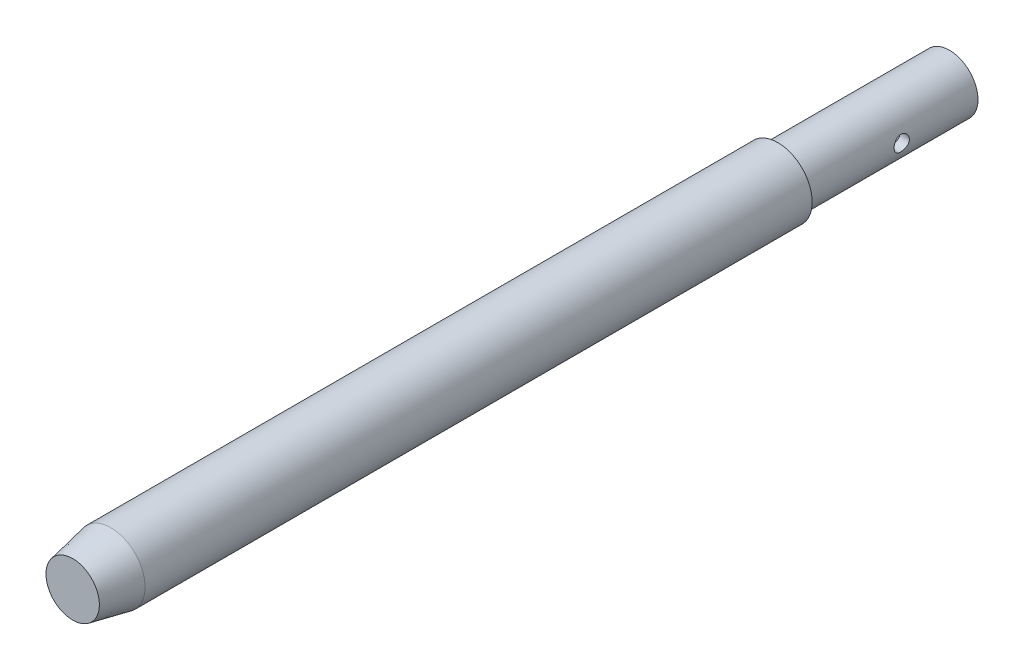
ISO-10303-21;
HEADER;
FILE_DESCRIPTION(('STEP AP214'),'2;1');
FILE_NAME('part.step','',(''),(''),'','','');
FILE_SCHEMA(('AUTOMOTIVE_DESIGN { 1 0 10303 214 1 1 1 1 }'));
ENDSEC;
DATA;
#1=APPLICATION_CONTEXT('core data for automotive mechanical design processes');
#2=APPLICATION_PROTOCOL_DEFINITION('international standard','automotive_design',2000,#1);
#3=PRODUCT_CONTEXT('',#1,'mechanical');
#4=PRODUCT('Part','Part','',(#3));
#5=PRODUCT_RELATED_PRODUCT_CATEGORY('part','',(#4));
#6=PRODUCT_DEFINITION_FORMATION('','',#4);
#7=PRODUCT_DEFINITION_CONTEXT('part definition',#1,'design');
#8=PRODUCT_DEFINITION('design','',#6,#7);
#9=PRODUCT_DEFINITION_SHAPE('','',#8);
#10=(LENGTH_UNIT() NAMED_UNIT(*) SI_UNIT(.MILLI.,.METRE.));
#11=(NAMED_UNIT(*) PLANE_ANGLE_UNIT() SI_UNIT($,.RADIAN.));
#12=(NAMED_UNIT(*) SI_UNIT($,.STERADIAN.) SOLID_ANGLE_UNIT());
#13=UNCERTAINTY_MEASURE_WITH_UNIT(LENGTH_MEASURE(1.E-05),#10,'distance_accuracy_value','');
#14=(GEOMETRIC_REPRESENTATION_CONTEXT(3) GLOBAL_UNCERTAINTY_ASSIGNED_CONTEXT((#13)) GLOBAL_UNIT_ASSIGNED_CONTEXT((#10,
#11,#12)) REPRESENTATION_CONTEXT('',''));
#15=CARTESIAN_POINT('',(0.,0.,0.));
#16=DIRECTION('',(0.,0.,1.));
#17=DIRECTION('',(1.,0.,0.));
#18=AXIS2_PLACEMENT_3D('',#15,#16,#17);
#19=CARTESIAN_POINT('',(0.,0.,0.));
#20=DIRECTION('',(0.,0.,1.));
#21=DIRECTION('',(1.,0.,0.));
#22=AXIS2_PLACEMENT_3D('',#19,#20,#21);
#23=PLANE('',#22);
#24=CARTESIAN_POINT('',(0.,0.,0.));
#25=DIRECTION('',(0.,0.,1.));
#26=DIRECTION('',(1.,0.,0.));
#27=AXIS2_PLACEMENT_3D('',#24,#25,#26);
#28=CIRCLE('',#27,9.);
#29=CARTESIAN_POINT('',(9.,0.,0.));
#30=VERTEX_POINT('',#29);
#31=EDGE_CURVE('E45',#30,#30,#28,.T.);
#32=ORIENTED_EDGE('',*,*,#31,.F.);
#33=EDGE_LOOP('',(#32));
#34=FACE_BOUND('',#33,.T.);
#35=CARTESIAN_POINT('',(0.,0.,0.));
#36=DIRECTION('',(0.,0.,1.));
#37=DIRECTION('',(1.,0.,0.));
#38=AXIS2_PLACEMENT_3D('',#35,#36,#37);
#39=CIRCLE('',#38,7.5);
#40=CARTESIAN_POINT('',(7.5,0.,0.));
#41=VERTEX_POINT('',#40);
#42=EDGE_CURVE('E10',#41,#41,#39,.F.);
#43=ORIENTED_EDGE('',*,*,#42,.F.);
#44=EDGE_LOOP('',(#43));
#45=FACE_BOUND('',#44,.T.);
#46=ADVANCED_FACE('F30',(#34,#45),#23,.F.);
#47=CARTESIAN_POINT('',(0.,0.,185.));
#48=DIRECTION('',(0.,0.,-1.));
#49=DIRECTION('',(-1.,0.,0.));
#50=AXIS2_PLACEMENT_3D('',#47,#48,#49);
#51=CYLINDRICAL_SURFACE('',#50,9.);
#52=CARTESIAN_POINT('',(0.,0.,175.));
#53=DIRECTION('',(0.,0.,1.));
#54=DIRECTION('',(1.,0.,0.));
#55=AXIS2_PLACEMENT_3D('',#52,#53,#54);
#56=CIRCLE('',#55,9.);
#57=CARTESIAN_POINT('',(-9.,0.,175.));
#58=VERTEX_POINT('',#57);
#59=EDGE_CURVE('E37',#58,#58,#56,.F.);
#60=ORIENTED_EDGE('',*,*,#59,.T.);
#61=EDGE_LOOP('',(#60));
#62=FACE_BOUND('',#61,.T.);
#63=ORIENTED_EDGE('',*,*,#31,.T.);
#64=EDGE_LOOP('',(#63));
#65=FACE_BOUND('',#64,.T.);
#66=ADVANCED_FACE('F97',(#62,#65),#51,.T.);
#67=CARTESIAN_POINT('',(0.,0.,185.));
#68=DIRECTION('',(0.,0.,1.));
#69=DIRECTION('',(1.,0.,0.));
#70=AXIS2_PLACEMENT_3D('',#67,#68,#69);
#71=PLANE('',#70);
#72=CARTESIAN_POINT('',(0.,0.,185.));
#73=DIRECTION('',(0.,0.,1.));
#74=DIRECTION('',(1.,0.,0.));
#75=AXIS2_PLACEMENT_3D('',#72,#73,#74);
#76=CIRCLE('',#75,6.99999999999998);
#77=CARTESIAN_POINT('',(-6.99999999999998,0.,185.));
#78=VERTEX_POINT('',#77);
#79=EDGE_CURVE('E41',#78,#78,#76,.T.);
#80=ORIENTED_EDGE('',*,*,#79,.T.);
#81=EDGE_LOOP('',(#80));
#82=FACE_BOUND('',#81,.T.);
#83=ADVANCED_FACE('F94',(#82),#71,.T.);
#84=CARTESIAN_POINT('',(0.,0.,185.));
#85=DIRECTION('',(0.,0.,-1.));
#86=DIRECTION('',(-1.,0.,0.));
#87=AXIS2_PLACEMENT_3D('',#84,#85,#86);
#88=CONICAL_SURFACE('',#87,6.99999999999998,0.197395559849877);
#89=CARTESIAN_POINT('',(-9.,0.,175.));
#90=CARTESIAN_POINT('',(-8.97916666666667,0.,175.104166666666));
#91=CARTESIAN_POINT('',(-8.95833333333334,0.,175.208333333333));
#92=CARTESIAN_POINT('',(-8.91666666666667,0.,175.416666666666));
#93=CARTESIAN_POINT('',(-8.89583333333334,0.,175.520833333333));
#94=CARTESIAN_POINT('',(-8.85416666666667,0.,175.729166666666));
#95=CARTESIAN_POINT('',(-8.83333333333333,0.,175.833333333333));
#96=CARTESIAN_POINT('',(-8.79166666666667,0.,176.041666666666));
#97=CARTESIAN_POINT('',(-8.77083333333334,0.,176.145833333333));
#98=CARTESIAN_POINT('',(-8.72916666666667,0.,176.354166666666));
#99=CARTESIAN_POINT('',(-8.70833333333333,0.,176.458333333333));
#100=CARTESIAN_POINT('',(-8.66666666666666,0.,176.666666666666));
#101=CARTESIAN_POINT('',(-8.64583333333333,0.,176.770833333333));
#102=CARTESIAN_POINT('',(-8.60416666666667,0.,176.979166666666));
#103=CARTESIAN_POINT('',(-8.58333333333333,0.,177.083333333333));
#104=CARTESIAN_POINT('',(-8.54166666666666,0.,177.291666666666));
#105=CARTESIAN_POINT('',(-8.52083333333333,0.,177.395833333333));
#106=CARTESIAN_POINT('',(-8.47916666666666,0.,177.604166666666));
#107=CARTESIAN_POINT('',(-8.45833333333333,0.,177.708333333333));
#108=CARTESIAN_POINT('',(-8.41666666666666,0.,177.916666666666));
#109=CARTESIAN_POINT('',(-8.39583333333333,0.,178.020833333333));
#110=CARTESIAN_POINT('',(-8.35416666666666,0.,178.229166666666));
#111=CARTESIAN_POINT('',(-8.33333333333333,0.,178.333333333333));
#112=CARTESIAN_POINT('',(-8.29166666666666,0.,178.541666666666));
#113=CARTESIAN_POINT('',(-8.27083333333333,0.,178.645833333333));
#114=CARTESIAN_POINT('',(-8.22916666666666,0.,178.854166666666));
#115=CARTESIAN_POINT('',(-8.20833333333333,0.,178.958333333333));
#116=CARTESIAN_POINT('',(-8.16666666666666,0.,179.166666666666));
#117=CARTESIAN_POINT('',(-8.14583333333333,0.,179.270833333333));
#118=CARTESIAN_POINT('',(-8.10416666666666,0.,179.479166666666));
#119=CARTESIAN_POINT('',(-8.08333333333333,0.,179.583333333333));
#120=CARTESIAN_POINT('',(-8.04166666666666,0.,179.791666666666));
#121=CARTESIAN_POINT('',(-8.02083333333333,0.,179.895833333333));
#122=CARTESIAN_POINT('',(-7.97916666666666,0.,180.104166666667));
#123=CARTESIAN_POINT('',(-7.95833333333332,0.,180.208333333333));
#124=CARTESIAN_POINT('',(-7.91666666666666,0.,180.416666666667));
#125=CARTESIAN_POINT('',(-7.89583333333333,0.,180.520833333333));
#126=CARTESIAN_POINT('',(-7.85416666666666,0.,180.729166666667));
#127=CARTESIAN_POINT('',(-7.83333333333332,0.,180.833333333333));
#128=CARTESIAN_POINT('',(-7.79166666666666,0.,181.041666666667));
#129=CARTESIAN_POINT('',(-7.77083333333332,0.,181.145833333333));
#130=CARTESIAN_POINT('',(-7.72916666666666,0.,181.354166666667));
#131=CARTESIAN_POINT('',(-7.70833333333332,0.,181.458333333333));
#132=CARTESIAN_POINT('',(-7.66666666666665,0.,181.666666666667));
#133=CARTESIAN_POINT('',(-7.64583333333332,0.,181.770833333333));
#134=CARTESIAN_POINT('',(-7.60416666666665,0.,181.979166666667));
#135=CARTESIAN_POINT('',(-7.58333333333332,0.,182.083333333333));
#136=CARTESIAN_POINT('',(-7.54166666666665,0.,182.291666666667));
#137=CARTESIAN_POINT('',(-7.52083333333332,0.,182.395833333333));
#138=CARTESIAN_POINT('',(-7.47916666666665,0.,182.604166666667));
#139=CARTESIAN_POINT('',(-7.45833333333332,0.,182.708333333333));
#140=CARTESIAN_POINT('',(-7.41666666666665,0.,182.916666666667));
#141=CARTESIAN_POINT('',(-7.39583333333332,0.,183.020833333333));
#142=CARTESIAN_POINT('',(-7.35416666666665,0.,183.229166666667));
#143=CARTESIAN_POINT('',(-7.33333333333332,0.,183.333333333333));
#144=CARTESIAN_POINT('',(-7.29166666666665,0.,183.541666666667));
#145=CARTESIAN_POINT('',(-7.27083333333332,0.,183.645833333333));
#146=CARTESIAN_POINT('',(-7.22916666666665,0.,183.854166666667));
#147=CARTESIAN_POINT('',(-7.20833333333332,0.,183.958333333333));
#148=CARTESIAN_POINT('',(-7.16666666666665,0.,184.166666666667));
#149=CARTESIAN_POINT('',(-7.14583333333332,0.,184.270833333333));
#150=CARTESIAN_POINT('',(-7.10416666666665,0.,184.479166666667));
#151=CARTESIAN_POINT('',(-7.08333333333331,0.,184.583333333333));
#152=CARTESIAN_POINT('',(-7.04166666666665,0.,184.791666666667));
#153=CARTESIAN_POINT('',(-7.02083333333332,0.,184.895833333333));
#154=CARTESIAN_POINT('',(-6.99999999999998,0.,185.));
#155=B_SPLINE_CURVE_WITH_KNOTS('',3,(#89,#90,#91,#92,#93,#94,#95,#96,#97,#98,#99,#100,#101,#102,
#103,#104,#105,#106,#107,#108,#109,#110,#111,#112,#113,#114,#115,#116,#117,#118,#119,#120,#121,
#122,#123,#124,#125,#126,#127,#128,#129,#130,#131,#132,#133,#134,#135,#136,#137,#138,#139,#140,
#141,#142,#143,#144,#145,#146,#147,#148,#149,#150,#151,#152,#153,#154),.UNSPECIFIED.,.F.,.F.,(4,
2,2,2,2,2,2,2,2,2,2,2,2,2,2,2,2,2,2,2,2,2,2,2,2,2,2,2,2,2,2,2,4),(0.,0.31868871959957,
0.63737743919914,0.956066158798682,1.27475487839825,1.59344359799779,1.91213231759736,
2.23082103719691,2.54950975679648,2.86819847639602,3.18688719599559,3.50557591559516,
3.8242646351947,4.14295335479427,4.46164207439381,4.78033079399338,5.09901951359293,
5.4177082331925,5.73639695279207,6.05508567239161,6.37377439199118,6.69246311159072,
7.01115183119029,7.32984055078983,7.6485292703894,7.96721798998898,8.28590670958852,
8.60459542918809,8.92328414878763,9.2419728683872,9.56066158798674,9.87935030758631,
10.1980390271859),.UNSPECIFIED.);
#156=EDGE_CURVE('BSEAM32',#58,#78,#155,.T.);
#157=ORIENTED_EDGE('',*,*,#59,.F.);
#158=ORIENTED_EDGE('',*,*,#79,.F.);
#159=ORIENTED_EDGE('',*,*,#156,.T.);
#160=ORIENTED_EDGE('',*,*,#156,.F.);
#161=EDGE_LOOP('',(#157,#159,#158,#160));
#162=FACE_BOUND('',#161,.T.);
#163=ADVANCED_FACE('F32',(#162),#88,.T.);
#164=CARTESIAN_POINT('',(0.,0.,-45.));
#165=DIRECTION('',(0.,0.,1.));
#166=DIRECTION('',(1.,0.,0.));
#167=AXIS2_PLACEMENT_3D('',#164,#165,#166);
#168=CYLINDRICAL_SURFACE('',#167,7.5);
#169=CARTESIAN_POINT('',(7.5,0.,-27.));
#170=CARTESIAN_POINT('',(7.49999833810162,0.110254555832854,-26.9999973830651));
#171=CARTESIAN_POINT('',(7.49754486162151,0.22053716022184,-26.9908523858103));
#172=CARTESIAN_POINT('',(7.48799573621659,0.437925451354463,-26.9545787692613));
#173=CARTESIAN_POINT('',(7.48089785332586,0.545029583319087,-26.9274414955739));
#174=CARTESIAN_POINT('',(7.4628433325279,0.752891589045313,-26.856128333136));
#175=CARTESIAN_POINT('',(7.45189167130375,0.853657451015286,-26.811974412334));
#176=CARTESIAN_POINT('',(7.42728699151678,1.04635368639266,-26.7079627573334));
#177=CARTESIAN_POINT('',(7.4136337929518,1.13828347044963,-26.6481039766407));
#178=CARTESIAN_POINT('',(7.38474614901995,1.31282950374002,-26.5129164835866));
#179=CARTESIAN_POINT('',(7.36948467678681,1.39521168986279,-26.4372913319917));
#180=CARTESIAN_POINT('',(7.33927409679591,1.54628713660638,-26.2733515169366));
#181=CARTESIAN_POINT('',(7.32432502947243,1.61497863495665,-26.1850352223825));
#182=CARTESIAN_POINT('',(7.29615537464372,1.73786409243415,-25.9963517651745));
#183=CARTESIAN_POINT('',(7.28296888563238,1.79178877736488,-25.8958036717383));
#184=CARTESIAN_POINT('',(7.26021477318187,1.88187548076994,-25.6866598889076));
#185=CARTESIAN_POINT('',(7.25064648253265,1.91804077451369,-25.5780656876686));
#186=CARTESIAN_POINT('',(7.23649115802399,1.97076920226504,-25.358504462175));
#187=CARTESIAN_POINT('',(7.2317964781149,1.98775670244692,-25.2476464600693));
#188=CARTESIAN_POINT('',(7.2275983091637,2.0029703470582,-25.0245623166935));
#189=CARTESIAN_POINT('',(7.22809385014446,2.00119999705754,-24.9123364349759));
#190=CARTESIAN_POINT('',(7.2341237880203,1.97928510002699,-24.6930145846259));
#191=CARTESIAN_POINT('',(7.23951735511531,1.95965406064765,-24.5858628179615));
#192=CARTESIAN_POINT('',(7.25451013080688,1.90339748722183,-24.3764316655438));
#193=CARTESIAN_POINT('',(7.26410967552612,1.86677059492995,-24.2741526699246));
#194=CARTESIAN_POINT('',(7.28655661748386,1.77714356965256,-24.0760318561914));
#195=CARTESIAN_POINT('',(7.29943942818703,1.72396341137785,-23.9802756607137));
#196=CARTESIAN_POINT('',(7.32698229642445,1.60286503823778,-23.7988658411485));
#197=CARTESIAN_POINT('',(7.34164270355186,1.53494392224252,-23.7132142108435));
#198=CARTESIAN_POINT('',(7.37167510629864,1.38366607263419,-23.5515110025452));
#199=CARTESIAN_POINT('',(7.38705471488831,1.29987812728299,-23.475863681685));
#200=CARTESIAN_POINT('',(7.41636381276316,1.12061766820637,-23.3396112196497));
#201=CARTESIAN_POINT('',(7.43029324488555,1.02514469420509,-23.2790066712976));
#202=CARTESIAN_POINT('',(7.45521820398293,0.824598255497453,-23.1743820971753));
#203=CARTESIAN_POINT('',(7.4662007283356,0.719484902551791,-23.1304352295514));
#204=CARTESIAN_POINT('',(7.48390044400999,0.503002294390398,-23.0609528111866));
#205=CARTESIAN_POINT('',(7.49061856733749,0.391634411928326,-23.035413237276));
#206=CARTESIAN_POINT('',(7.49889158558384,0.169254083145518,-23.0041051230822));
#207=CARTESIAN_POINT('',(7.50058997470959,0.0583242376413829,-22.9977869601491));
#208=CARTESIAN_POINT('',(7.49904471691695,-0.163010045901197,-23.0035831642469));
#209=CARTESIAN_POINT('',(7.49580158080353,-0.273414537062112,-23.0156956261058));
#210=CARTESIAN_POINT('',(7.48483035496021,-0.488602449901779,-23.05755844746));
#211=CARTESIAN_POINT('',(7.47718026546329,-0.593449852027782,-23.0870022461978));
#212=CARTESIAN_POINT('',(7.45826294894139,-0.796706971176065,-23.1623359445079));
#213=CARTESIAN_POINT('',(7.44699532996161,-0.895115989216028,-23.2082276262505));
#214=CARTESIAN_POINT('',(7.42175660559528,-1.08483847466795,-23.3161738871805));
#215=CARTESIAN_POINT('',(7.40773686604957,-1.17597518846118,-23.3785274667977));
#216=CARTESIAN_POINT('',(7.37861452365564,-1.34668463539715,-23.517251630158));
#217=CARTESIAN_POINT('',(7.3635117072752,-1.42625507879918,-23.593624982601));
#218=CARTESIAN_POINT('',(7.33339745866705,-1.57388924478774,-23.7607855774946));
#219=CARTESIAN_POINT('',(7.31840061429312,-1.64156519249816,-23.8519185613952));
#220=CARTESIAN_POINT('',(7.29066447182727,-1.76067191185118,-24.0445646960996));
#221=CARTESIAN_POINT('',(7.27792507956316,-1.81210336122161,-24.1460774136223));
#222=CARTESIAN_POINT('',(7.2562926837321,-1.89687411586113,-24.3560953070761));
#223=CARTESIAN_POINT('',(7.24737748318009,-1.93031812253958,-24.4645558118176));
#224=CARTESIAN_POINT('',(7.234398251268,-1.97841205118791,-24.6858393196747));
#225=CARTESIAN_POINT('',(7.23033298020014,-1.99306677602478,-24.7986612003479));
#226=CARTESIAN_POINT('',(7.22761744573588,-2.00288989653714,-25.0214947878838));
#227=CARTESIAN_POINT('',(7.22879397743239,-1.99868155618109,-25.1314773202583));
#228=CARTESIAN_POINT('',(7.23602396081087,-1.97234376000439,-25.34910351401));
#229=CARTESIAN_POINT('',(7.24207728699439,-1.95021476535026,-25.4567472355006));
#230=CARTESIAN_POINT('',(7.25827571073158,-1.889025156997,-25.6658557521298));
#231=CARTESIAN_POINT('',(7.26838885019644,-1.8500966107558,-25.7673618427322));
#232=CARTESIAN_POINT('',(7.29156818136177,-1.75651554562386,-25.9624788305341));
#233=CARTESIAN_POINT('',(7.30463483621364,-1.70186056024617,-26.0560884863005));
#234=CARTESIAN_POINT('',(7.3327292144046,-1.57648909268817,-26.2357303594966));
#235=CARTESIAN_POINT('',(7.3478033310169,-1.5053472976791,-26.3214585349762));
#236=CARTESIAN_POINT('',(7.37795503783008,-1.349830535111,-26.4799624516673));
#237=CARTESIAN_POINT('',(7.39303262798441,-1.26545235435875,-26.5527350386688));
#238=CARTESIAN_POINT('',(7.42187812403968,-1.08367998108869,-26.6847922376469));
#239=CARTESIAN_POINT('',(7.43561111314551,-0.986045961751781,-26.7437550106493));
#240=CARTESIAN_POINT('',(7.45983810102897,-0.781888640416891,-26.8443374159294));
#241=CARTESIAN_POINT('',(7.47033417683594,-0.675371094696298,-26.8859681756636));
#242=CARTESIAN_POINT('',(7.48554752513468,-0.474374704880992,-26.9452752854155));
#243=CARTESIAN_POINT('',(7.49092770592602,-0.380762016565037,-26.9657493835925));
#244=CARTESIAN_POINT('',(7.49815449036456,-0.191439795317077,-26.9931122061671));
#245=CARTESIAN_POINT('',(7.5000014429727,-0.0957304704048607,-27.0000022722));
#246=CARTESIAN_POINT('',(7.5,0.,-27.));
#247=B_SPLINE_CURVE_WITH_KNOTS('',3,(#169,#170,#171,#172,#173,#174,#175,#176,#177,#178,#179,
#180,#181,#182,#183,#184,#185,#186,#187,#188,#189,#190,#191,#192,#193,#194,#195,#196,#197,#198,
#199,#200,#201,#202,#203,#204,#205,#206,#207,#208,#209,#210,#211,#212,#213,#214,#215,#216,#217,
#218,#219,#220,#221,#222,#223,#224,#225,#226,#227,#228,#229,#230,#231,#232,#233,#234,#235,#236,
#237,#238,#239,#240,#241,#242,#243,#244,#245,#246),.UNSPECIFIED.,.T.,.F.,(4,2,2,2,2,2,2,2,2,2,2,
2,2,2,2,2,2,2,2,2,2,2,2,2,2,2,2,2,2,2,2,2,2,2,2,2,2,2,4),(0.,0.330412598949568,
0.660984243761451,0.991130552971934,1.32129886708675,1.65834897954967,1.99544244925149,
2.33832582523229,2.681145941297,3.01622158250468,3.3512346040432,3.67691002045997,
4.0026114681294,4.33198673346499,4.6614268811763,5.00161259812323,5.34181171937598,
5.68348809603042,6.02508977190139,6.35682717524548,6.68853028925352,7.01453535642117,
7.34057575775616,7.67300286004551,8.00549568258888,8.34736496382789,8.68921998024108,
9.02906297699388,9.36881908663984,9.69743342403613,10.026039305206,10.352107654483,
10.67822717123,11.0139433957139,11.3497412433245,11.692722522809,12.0354832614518,
12.3223981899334,12.6092847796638),.UNSPECIFIED.);
#248=CARTESIAN_POINT('',(7.5,0.,-27.));
#249=VERTEX_POINT('',#248);
#250=EDGE_CURVE('E57',#249,#249,#247,.T.);
#251=ORIENTED_EDGE('',*,*,#250,.F.);
#252=EDGE_LOOP('',(#251));
#253=FACE_BOUND('',#252,.T.);
#254=CARTESIAN_POINT('',(0.,0.,-45.));
#255=DIRECTION('',(0.,0.,-1.));
#256=DIRECTION('',(-1.,0.,0.));
#257=AXIS2_PLACEMENT_3D('',#254,#255,#256);
#258=CIRCLE('',#257,7.5);
#259=CARTESIAN_POINT('',(-7.5,0.,-45.));
#260=VERTEX_POINT('',#259);
#261=EDGE_CURVE('E50',#260,#260,#258,.T.);
#262=ORIENTED_EDGE('',*,*,#261,.F.);
#263=EDGE_LOOP('',(#262));
#264=FACE_BOUND('',#263,.T.);
#265=ORIENTED_EDGE('',*,*,#42,.T.);
#266=EDGE_LOOP('',(#265));
#267=FACE_BOUND('',#266,.T.);
#268=ADVANCED_FACE('F89',(#253,#264,#267),#168,.T.);
#269=CARTESIAN_POINT('',(0.,0.,-45.));
#270=DIRECTION('',(0.,0.,-1.));
#271=DIRECTION('',(-1.,0.,0.));
#272=AXIS2_PLACEMENT_3D('',#269,#270,#271);
#273=PLANE('',#272);
#274=CARTESIAN_POINT('',(0.,0.,-45.));
#275=DIRECTION('',(0.,0.,-1.));
#276=DIRECTION('',(-1.,0.,0.));
#277=AXIS2_PLACEMENT_3D('',#274,#275,#276);
#278=CIRCLE('',#277,5.);
#279=CARTESIAN_POINT('',(-5.,0.,-45.));
#280=VERTEX_POINT('',#279);
#281=EDGE_CURVE('E54',#280,#280,#278,.T.);
#282=ORIENTED_EDGE('',*,*,#281,.F.);
#283=EDGE_LOOP('',(#282));
#284=FACE_BOUND('',#283,.T.);
#285=ORIENTED_EDGE('',*,*,#261,.T.);
#286=EDGE_LOOP('',(#285));
#287=FACE_BOUND('',#286,.T.);
#288=ADVANCED_FACE('F85',(#284,#287),#273,.T.);
#289=CARTESIAN_POINT('',(0.,0.,-9.99999999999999));
#290=DIRECTION('',(0.,0.,-1.));
#291=DIRECTION('',(-1.,0.,0.));
#292=AXIS2_PLACEMENT_3D('',#289,#290,#291);
#293=CYLINDRICAL_SURFACE('',#292,5.);
#294=CARTESIAN_POINT('',(5.,0.,-27.));
#295=CARTESIAN_POINT('',(4.99999271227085,-0.107493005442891,-26.9999901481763));
#296=CARTESIAN_POINT('',(4.99649294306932,-0.215172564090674,-26.9912822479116));
#297=CARTESIAN_POINT('',(4.98283453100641,-0.427496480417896,-26.9567522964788));
#298=CARTESIAN_POINT('',(4.97265778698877,-0.532131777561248,-26.9308837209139));
#299=CARTESIAN_POINT('',(4.94674209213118,-0.734953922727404,-26.8631239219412));
#300=CARTESIAN_POINT('',(4.93102136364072,-0.83316066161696,-26.8212851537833));
#301=CARTESIAN_POINT('',(4.89556610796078,-1.02107197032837,-26.7229808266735));
#302=CARTESIAN_POINT('',(4.87583297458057,-1.11077947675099,-26.6665203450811));
#303=CARTESIAN_POINT('',(4.83330886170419,-1.28350100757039,-26.5377645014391));
#304=CARTESIAN_POINT('',(4.81042296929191,-1.36606227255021,-26.4648933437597));
#305=CARTESIAN_POINT('',(4.76460576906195,-1.51817500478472,-26.3065999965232));
#306=CARTESIAN_POINT('',(4.74167444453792,-1.58772010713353,-26.2211717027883));
#307=CARTESIAN_POINT('',(4.69722791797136,-1.71487456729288,-26.0355719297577));
#308=CARTESIAN_POINT('',(4.67582115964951,-1.77181498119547,-25.9349135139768));
#309=CARTESIAN_POINT('',(4.63833647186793,-1.86775471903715,-25.72446360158));
#310=CARTESIAN_POINT('',(4.62225601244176,-1.90676256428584,-25.6146764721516));
#311=CARTESIAN_POINT('',(4.59826357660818,-1.96389882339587,-25.3942876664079));
#312=CARTESIAN_POINT('',(4.59001420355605,-1.98289396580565,-25.2839487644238));
#313=CARTESIAN_POINT('',(4.58164004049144,-2.00217296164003,-25.0613650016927));
#314=CARTESIAN_POINT('',(4.58151125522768,-2.00246601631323,-24.949121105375));
#315=CARTESIAN_POINT('',(4.58910500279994,-1.98498936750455,-24.734243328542));
#316=CARTESIAN_POINT('',(4.5962817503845,-1.96847531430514,-24.631484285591));
#317=CARTESIAN_POINT('',(4.61676187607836,-1.91994688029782,-24.4303404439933));
#318=CARTESIAN_POINT('',(4.63006632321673,-1.88792979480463,-24.3319564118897));
#319=CARTESIAN_POINT('',(4.6615948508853,-1.80869473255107,-24.139982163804));
#320=CARTESIAN_POINT('',(4.67991379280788,-1.76117986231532,-24.0465307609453));
#321=CARTESIAN_POINT('',(4.7193811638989,-1.65250646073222,-23.8685841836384));
#322=CARTESIAN_POINT('',(4.74053065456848,-1.59134280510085,-23.7840923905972));
#323=CARTESIAN_POINT('',(4.78526736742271,-1.45155059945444,-23.619590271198));
#324=CARTESIAN_POINT('',(4.80891664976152,-1.37193746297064,-23.540431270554));
#325=CARTESIAN_POINT('',(4.85459824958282,-1.20031442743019,-23.396315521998));
#326=CARTESIAN_POINT('',(4.87663024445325,-1.10830206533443,-23.3313616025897));
#327=CARTESIAN_POINT('',(4.91714681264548,-0.912077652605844,-23.2163825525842));
#328=CARTESIAN_POINT('',(4.93555270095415,-0.807660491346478,-23.1666777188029));
#329=CARTESIAN_POINT('',(4.96614828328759,-0.591023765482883,-23.0858321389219));
#330=CARTESIAN_POINT('',(4.97834113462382,-0.478808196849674,-23.0546819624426));
#331=CARTESIAN_POINT('',(4.99456139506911,-0.25689588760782,-23.0135517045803));
#332=CARTESIAN_POINT('',(4.99902945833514,-0.147443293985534,-23.0024275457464));
#333=CARTESIAN_POINT('',(5.00068478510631,0.0718453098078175,-22.9982868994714));
#334=CARTESIAN_POINT('',(4.99787393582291,0.181681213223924,-23.0052657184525));
#335=CARTESIAN_POINT('',(4.98557567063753,0.393432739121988,-23.036291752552));
#336=CARTESIAN_POINT('',(4.97639391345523,0.495482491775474,-23.059557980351));
#337=CARTESIAN_POINT('',(4.952594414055,0.69413542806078,-23.1214357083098));
#338=CARTESIAN_POINT('',(4.9379759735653,0.790737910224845,-23.1600491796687));
#339=CARTESIAN_POINT('',(4.90416594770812,0.979078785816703,-23.2527849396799));
#340=CARTESIAN_POINT('',(4.88484815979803,1.07057802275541,-23.3073454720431));
#341=CARTESIAN_POINT('',(4.84373364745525,1.24344359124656,-23.4299403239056));
#342=CARTESIAN_POINT('',(4.8219359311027,1.32480584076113,-23.4979800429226));
#343=CARTESIAN_POINT('',(4.77645117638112,1.48072304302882,-23.6508700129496));
#344=CARTESIAN_POINT('',(4.75273441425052,1.55447393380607,-23.7365335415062));
#345=CARTESIAN_POINT('',(4.70741672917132,1.68675119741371,-23.9194400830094));
#346=CARTESIAN_POINT('',(4.68581615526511,1.74527506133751,-24.0166850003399));
#347=CARTESIAN_POINT('',(4.64714299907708,1.84580750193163,-24.2214616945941));
#348=CARTESIAN_POINT('',(4.63011630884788,1.88765059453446,-24.3290839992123));
#349=CARTESIAN_POINT('',(4.60323673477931,1.95229621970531,-24.5507336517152));
#350=CARTESIAN_POINT('',(4.59337855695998,1.97511280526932,-24.6647562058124));
#351=CARTESIAN_POINT('',(4.58271759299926,1.9997156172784,-24.8871279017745));
#352=CARTESIAN_POINT('',(4.58131421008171,2.00289708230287,-24.9952948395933));
#353=CARTESIAN_POINT('',(4.58614836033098,1.99180315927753,-25.2105448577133));
#354=CARTESIAN_POINT('',(4.59238492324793,1.97752998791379,-25.3176280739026));
#355=CARTESIAN_POINT('',(4.6112664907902,1.93307136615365,-25.523332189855));
#356=CARTESIAN_POINT('',(4.62364831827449,1.90353749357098,-25.622120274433));
#357=CARTESIAN_POINT('',(4.65324001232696,1.83000544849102,-25.8133786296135));
#358=CARTESIAN_POINT('',(4.67045121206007,1.78600328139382,-25.9058471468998));
#359=CARTESIAN_POINT('',(4.70898609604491,1.68187276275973,-26.0876096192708));
#360=CARTESIAN_POINT('',(4.73048882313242,1.62096533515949,-26.1764186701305));
#361=CARTESIAN_POINT('',(4.77463804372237,1.4858921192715,-26.3429933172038));
#362=CARTESIAN_POINT('',(4.79728488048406,1.41172233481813,-26.4207555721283));
#363=CARTESIAN_POINT('',(4.84293567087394,1.24650550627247,-26.5682028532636));
#364=CARTESIAN_POINT('',(4.86586757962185,1.15467600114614,-26.6370373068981));
#365=CARTESIAN_POINT('',(4.90800406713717,0.959900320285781,-26.7583370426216));
#366=CARTESIAN_POINT('',(4.92720691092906,0.85694900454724,-26.8107947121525));
#367=CARTESIAN_POINT('',(4.95939714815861,0.644738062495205,-26.8966222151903));
#368=CARTESIAN_POINT('',(4.97249363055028,0.535631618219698,-26.9303293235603));
#369=CARTESIAN_POINT('',(4.99144306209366,0.312876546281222,-26.9786391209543));
#370=CARTESIAN_POINT('',(4.99731899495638,0.199243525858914,-26.9933024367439));
#371=CARTESIAN_POINT('',(4.99975899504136,0.0569122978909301,-26.9993953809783));
#372=CARTESIAN_POINT('',(5.00000192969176,0.0284626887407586,-27.0000026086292));
#373=CARTESIAN_POINT('',(5.,0.,-27.));
#374=B_SPLINE_CURVE_WITH_KNOTS('',3,(#294,#295,#296,#297,#298,#299,#300,#301,#302,#303,#304,
#305,#306,#307,#308,#309,#310,#311,#312,#313,#314,#315,#316,#317,#318,#319,#320,#321,#322,#323,
#324,#325,#326,#327,#328,#329,#330,#331,#332,#333,#334,#335,#336,#337,#338,#339,#340,#341,#342,
#343,#344,#345,#346,#347,#348,#349,#350,#351,#352,#353,#354,#355,#356,#357,#358,#359,#360,#361,
#362,#363,#364,#365,#366,#367,#368,#369,#370,#371,#372,#373),.UNSPECIFIED.,.T.,.F.,(4,2,2,2,2,2,
2,2,2,2,2,2,2,2,2,2,2,2,2,2,2,2,2,2,2,2,2,2,2,2,2,2,2,2,2,2,2,2,2,4),(0.,0.322402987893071,
0.645683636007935,0.967911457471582,1.29002753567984,1.62597381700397,1.96208394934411,
2.31315258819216,2.66405423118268,2.99904105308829,3.33386306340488,3.64538328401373,
3.95695787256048,4.27489126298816,4.59294421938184,4.93558349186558,5.27829092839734,
5.62776913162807,5.97706956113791,6.30569184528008,6.63422893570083,6.94800455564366,
7.26182048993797,7.58523513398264,7.9087795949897,8.25368474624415,8.59864669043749,
8.94695045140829,9.29499672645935,9.61799673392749,9.94095572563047,10.2511431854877,
10.5614163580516,10.8894546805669,11.2175920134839,11.5670042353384,11.9165786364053,
12.2596430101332,12.6016125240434,12.686980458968),.UNSPECIFIED.);
#375=CARTESIAN_POINT('',(5.,0.,-27.));
#376=VERTEX_POINT('',#375);
#377=EDGE_CURVE('E60',#376,#376,#374,.T.);
#378=ORIENTED_EDGE('',*,*,#377,.F.);
#379=EDGE_LOOP('',(#378));
#380=FACE_BOUND('',#379,.T.);
#381=CARTESIAN_POINT('',(0.,0.,-9.99999999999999));
#382=DIRECTION('',(0.,0.,-1.));
#383=DIRECTION('',(-1.,0.,0.));
#384=AXIS2_PLACEMENT_3D('',#381,#382,#383);
#385=CIRCLE('',#384,5.);
#386=CARTESIAN_POINT('',(-5.,0.,-9.99999999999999));
#387=VERTEX_POINT('',#386);
#388=EDGE_CURVE('E53',#387,#387,#385,.T.);
#389=ORIENTED_EDGE('',*,*,#388,.F.);
#390=EDGE_LOOP('',(#389));
#391=FACE_BOUND('',#390,.T.);
#392=ORIENTED_EDGE('',*,*,#281,.T.);
#393=EDGE_LOOP('',(#392));
#394=FACE_BOUND('',#393,.T.);
#395=ADVANCED_FACE('F81',(#380,#391,#394),#293,.F.);
#396=CARTESIAN_POINT('',(0.,0.,-9.99999999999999));
#397=DIRECTION('',(0.,0.,-1.));
#398=DIRECTION('',(-1.,0.,0.));
#399=AXIS2_PLACEMENT_3D('',#396,#397,#398);
#400=PLANE('',#399);
#401=ORIENTED_EDGE('',*,*,#388,.T.);
#402=EDGE_LOOP('',(#401));
#403=FACE_BOUND('',#402,.T.);
#404=ADVANCED_FACE('F74',(#403),#400,.T.);
#405=CARTESIAN_POINT('',(-9.001,0.,-25.));
#406=DIRECTION('',(1.,0.,0.));
#407=DIRECTION('',(0.,0.,-1.));
#408=AXIS2_PLACEMENT_3D('',#405,#406,#407);
#409=CYLINDRICAL_SURFACE('',#408,2.);
#410=ORIENTED_EDGE('',*,*,#377,.T.);
#411=EDGE_LOOP('',(#410));
#412=FACE_BOUND('',#411,.T.);
#413=ORIENTED_EDGE('',*,*,#250,.T.);
#414=EDGE_LOOP('',(#413));
#415=FACE_BOUND('',#414,.T.);
#416=ADVANCED_FACE('F70',(#412,#415),#409,.F.);
#417=CLOSED_SHELL('',(#46,#66,#83,#163,#268,#288,#395,#404,#416));
#418=MANIFOLD_SOLID_BREP('B2',#417);
#419=ADVANCED_BREP_SHAPE_REPRESENTATION('',(#18,#418),#14);
#420=SHAPE_DEFINITION_REPRESENTATION(#9,#419);
ENDSEC;
END-ISO-10303-21;
